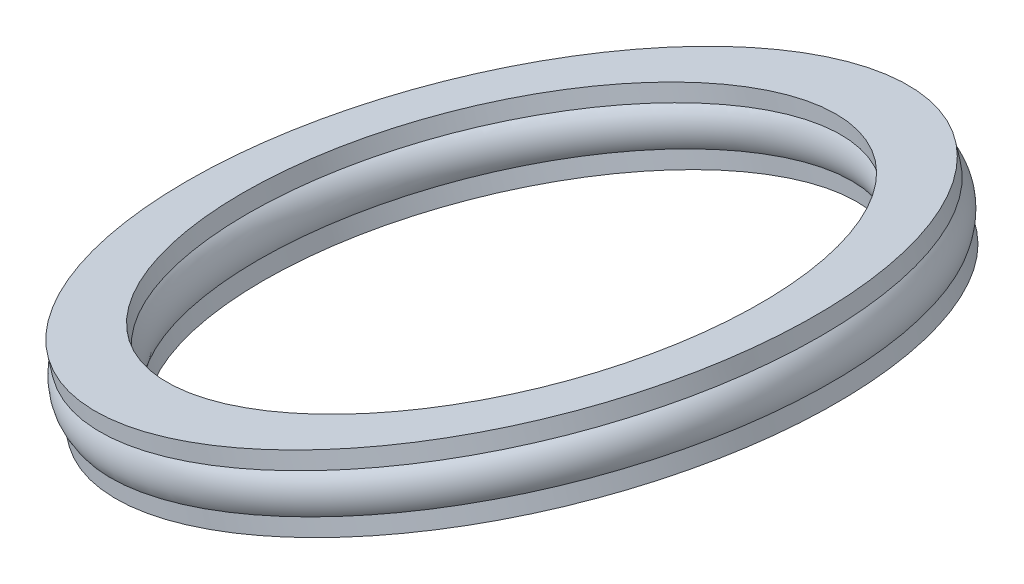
ISO-10303-21;
HEADER;
FILE_DESCRIPTION(('STEP AP214'),'2;1');
FILE_NAME('part.step','',(''),(''),'','','');
FILE_SCHEMA(('AUTOMOTIVE_DESIGN { 1 0 10303 214 1 1 1 1 }'));
ENDSEC;
DATA;
#1=APPLICATION_CONTEXT('core data for automotive mechanical design processes');
#2=APPLICATION_PROTOCOL_DEFINITION('international standard','automotive_design',2000,#1);
#3=PRODUCT_CONTEXT('',#1,'mechanical');
#4=PRODUCT('Part','Part','',(#3));
#5=PRODUCT_RELATED_PRODUCT_CATEGORY('part','',(#4));
#6=PRODUCT_DEFINITION_FORMATION('','',#4);
#7=PRODUCT_DEFINITION_CONTEXT('part definition',#1,'design');
#8=PRODUCT_DEFINITION('design','',#6,#7);
#9=PRODUCT_DEFINITION_SHAPE('','',#8);
#10=(LENGTH_UNIT() NAMED_UNIT(*) SI_UNIT(.MILLI.,.METRE.));
#11=(NAMED_UNIT(*) PLANE_ANGLE_UNIT() SI_UNIT($,.RADIAN.));
#12=(NAMED_UNIT(*) SI_UNIT($,.STERADIAN.) SOLID_ANGLE_UNIT());
#13=UNCERTAINTY_MEASURE_WITH_UNIT(LENGTH_MEASURE(1.E-05),#10,'distance_accuracy_value','');
#14=(GEOMETRIC_REPRESENTATION_CONTEXT(3) GLOBAL_UNCERTAINTY_ASSIGNED_CONTEXT((#13)) GLOBAL_UNIT_ASSIGNED_CONTEXT((#10,
#11,#12)) REPRESENTATION_CONTEXT('',''));
#15=CARTESIAN_POINT('',(0.,0.,0.));
#16=DIRECTION('',(0.,0.,1.));
#17=DIRECTION('',(1.,0.,0.));
#18=AXIS2_PLACEMENT_3D('',#15,#16,#17);
#19=CARTESIAN_POINT('',(408.798571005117,395.287429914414,0.));
#20=DIRECTION('',(-0.300714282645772,0.953714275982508,0.));
#21=DIRECTION('',(-0.953714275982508,-0.300714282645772,0.));
#22=AXIS2_PLACEMENT_3D('',#19,#20,#21);
#23=CYLINDRICAL_SURFACE('',#22,15.8000000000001);
#24=CARTESIAN_POINT('',(410.302142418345,390.518858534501,0.));
#25=DIRECTION('',(-0.300714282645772,0.953714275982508,0.));
#26=DIRECTION('',(-0.953714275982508,-0.300714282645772,0.));
#27=AXIS2_PLACEMENT_3D('',#24,#25,#26);
#28=CIRCLE('',#27,15.8);
#29=CARTESIAN_POINT('',(395.233456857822,385.767572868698,0.));
#30=VERTEX_POINT('',#29);
#31=EDGE_CURVE('E35',#30,#30,#28,.T.);
#32=ORIENTED_EDGE('',*,*,#31,.T.);
#33=EDGE_LOOP('',(#32));
#34=FACE_BOUND('',#33,.T.);
#35=CARTESIAN_POINT('',(410.586748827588,389.616230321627,0.));
#36=DIRECTION('',(0.300714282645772,-0.953714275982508,0.));
#37=DIRECTION('',(0.953714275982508,0.300714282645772,0.));
#38=AXIS2_PLACEMENT_3D('',#35,#36,#37);
#39=CIRCLE('',#38,15.8000000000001);
#40=CARTESIAN_POINT('',(425.655434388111,394.36751598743,0.));
#41=VERTEX_POINT('',#40);
#42=EDGE_CURVE('E10',#41,#41,#39,.F.);
#43=ORIENTED_EDGE('',*,*,#42,.F.);
#44=EDGE_LOOP('',(#43));
#45=FACE_BOUND('',#44,.T.);
#46=ADVANCED_FACE('F32',(#34,#45),#23,.F.);
#47=CARTESIAN_POINT('',(408.798571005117,395.287429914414,0.));
#48=DIRECTION('',(-0.300714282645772,0.953714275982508,0.));
#49=DIRECTION('',(-0.953714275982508,-0.300714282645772,0.));
#50=AXIS2_PLACEMENT_3D('',#47,#48,#49);
#51=CYLINDRICAL_SURFACE('',#50,19.2);
#52=CARTESIAN_POINT('',(410.302142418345,390.518858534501,0.));
#53=DIRECTION('',(-0.300714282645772,0.953714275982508,0.));
#54=DIRECTION('',(-0.953714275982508,-0.300714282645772,0.));
#55=AXIS2_PLACEMENT_3D('',#52,#53,#54);
#56=CIRCLE('',#55,19.2);
#57=CARTESIAN_POINT('',(391.990828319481,384.745144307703,0.));
#58=VERTEX_POINT('',#57);
#59=EDGE_CURVE('E53',#58,#58,#56,.T.);
#60=ORIENTED_EDGE('',*,*,#59,.F.);
#61=EDGE_LOOP('',(#60));
#62=FACE_BOUND('',#61,.T.);
#63=CARTESIAN_POINT('',(410.586748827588,389.616230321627,0.));
#64=DIRECTION('',(0.300714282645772,-0.953714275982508,0.));
#65=DIRECTION('',(0.953714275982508,0.300714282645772,0.));
#66=AXIS2_PLACEMENT_3D('',#63,#64,#65);
#67=CIRCLE('',#66,19.2);
#68=CARTESIAN_POINT('',(428.898062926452,395.389944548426,0.));
#69=VERTEX_POINT('',#68);
#70=EDGE_CURVE('E44',#69,#69,#67,.T.);
#71=ORIENTED_EDGE('',*,*,#70,.F.);
#72=EDGE_LOOP('',(#71));
#73=FACE_BOUND('',#72,.T.);
#74=ADVANCED_FACE('F70',(#62,#73),#51,.T.);
#75=CARTESIAN_POINT('',(425.370827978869,395.270144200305,0.));
#76=DIRECTION('',(0.300714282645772,-0.953714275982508,0.));
#77=DIRECTION('',(0.953714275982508,0.300714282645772,0.));
#78=AXIS2_PLACEMENT_3D('',#75,#76,#77);
#79=PLANE('',#78);
#80=ORIENTED_EDGE('',*,*,#59,.T.);
#81=EDGE_LOOP('',(#80));
#82=FACE_BOUND('',#81,.T.);
#83=ORIENTED_EDGE('',*,*,#31,.F.);
#84=EDGE_LOOP('',(#83));
#85=FACE_BOUND('',#84,.T.);
#86=ADVANCED_FACE('F72',(#82,#85),#79,.F.);
#87=CARTESIAN_POINT('',(410.903570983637,388.611429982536,0.));
#88=DIRECTION('',(-0.300714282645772,0.953714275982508,0.));
#89=DIRECTION('',(-0.953714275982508,-0.300714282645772,0.));
#90=AXIS2_PLACEMENT_3D('',#87,#88,#89);
#91=TOROIDAL_SURFACE('',#90,17.5,2.);
#92=CARTESIAN_POINT('',(411.220393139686,387.606629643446,0.));
#93=DIRECTION('',(-0.300714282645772,0.953714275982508,0.));
#94=DIRECTION('',(-0.953714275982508,-0.300714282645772,0.));
#95=AXIS2_PLACEMENT_3D('',#92,#93,#94);
#96=CIRCLE('',#95,19.2);
#97=CARTESIAN_POINT('',(392.909079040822,381.832915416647,0.));
#98=VERTEX_POINT('',#97);
#99=EDGE_CURVE('E58',#98,#98,#96,.T.);
#100=ORIENTED_EDGE('',*,*,#99,.T.);
#101=EDGE_LOOP('',(#100));
#102=FACE_BOUND('',#101,.T.);
#103=ORIENTED_EDGE('',*,*,#70,.T.);
#104=EDGE_LOOP('',(#103));
#105=FACE_BOUND('',#104,.T.);
#106=ADVANCED_FACE('F68',(#102,#105),#91,.T.);
#107=CARTESIAN_POINT('',(429.816313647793,392.47771565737,0.));
#108=DIRECTION('',(-0.300714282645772,0.953714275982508,0.));
#109=DIRECTION('',(-0.953714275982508,-0.300714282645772,0.));
#110=AXIS2_PLACEMENT_3D('',#107,#108,#109);
#111=PLANE('',#110);
#112=CARTESIAN_POINT('',(411.504999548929,386.704001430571,0.));
#113=DIRECTION('',(-0.300714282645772,0.953714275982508,0.));
#114=DIRECTION('',(-0.953714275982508,-0.300714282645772,0.));
#115=AXIS2_PLACEMENT_3D('',#112,#113,#114);
#116=CIRCLE('',#115,19.2000000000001);
#117=CARTESIAN_POINT('',(393.193685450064,380.930287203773,0.));
#118=VERTEX_POINT('',#117);
#119=EDGE_CURVE('E51',#118,#118,#116,.T.);
#120=ORIENTED_EDGE('',*,*,#119,.F.);
#121=EDGE_LOOP('',(#120));
#122=FACE_BOUND('',#121,.T.);
#123=CARTESIAN_POINT('',(411.504999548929,386.704001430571,0.));
#124=DIRECTION('',(-0.300714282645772,0.953714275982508,0.));
#125=DIRECTION('',(-0.953714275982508,-0.300714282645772,0.));
#126=AXIS2_PLACEMENT_3D('',#123,#124,#125);
#127=CIRCLE('',#126,15.8000000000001);
#128=CARTESIAN_POINT('',(396.436313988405,381.952715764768,0.));
#129=VERTEX_POINT('',#128);
#130=EDGE_CURVE('E48',#129,#129,#127,.T.);
#131=ORIENTED_EDGE('',*,*,#130,.T.);
#132=EDGE_LOOP('',(#131));
#133=FACE_BOUND('',#132,.T.);
#134=ADVANCED_FACE('F83',(#122,#133),#111,.F.);
#135=ORIENTED_EDGE('',*,*,#119,.T.);
#136=EDGE_LOOP('',(#135));
#137=FACE_BOUND('',#136,.T.);
#138=ORIENTED_EDGE('',*,*,#99,.F.);
#139=EDGE_LOOP('',(#138));
#140=FACE_BOUND('',#139,.T.);
#141=ADVANCED_FACE('F75',(#137,#140),#51,.T.);
#142=ORIENTED_EDGE('',*,*,#130,.F.);
#143=EDGE_LOOP('',(#142));
#144=FACE_BOUND('',#143,.T.);
#145=CARTESIAN_POINT('',(411.220393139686,387.606629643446,0.));
#146=DIRECTION('',(-0.300714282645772,0.953714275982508,0.));
#147=DIRECTION('',(-0.953714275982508,-0.300714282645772,0.));
#148=AXIS2_PLACEMENT_3D('',#145,#146,#147);
#149=CIRCLE('',#148,15.8000000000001);
#150=CARTESIAN_POINT('',(396.151707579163,382.855343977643,0.));
#151=VERTEX_POINT('',#150);
#152=EDGE_CURVE('E39',#151,#151,#149,.F.);
#153=ORIENTED_EDGE('',*,*,#152,.F.);
#154=EDGE_LOOP('',(#153));
#155=FACE_BOUND('',#154,.T.);
#156=ADVANCED_FACE('F80',(#144,#155),#23,.F.);
#157=ORIENTED_EDGE('',*,*,#152,.T.);
#158=EDGE_LOOP('',(#157));
#159=FACE_BOUND('',#158,.T.);
#160=ORIENTED_EDGE('',*,*,#42,.T.);
#161=EDGE_LOOP('',(#160));
#162=FACE_BOUND('',#161,.T.);
#163=ADVANCED_FACE('F89',(#159,#162),#91,.T.);
#164=CLOSED_SHELL('',(#46,#74,#86,#106,#134,#141,#156,#163));
#165=MANIFOLD_SOLID_BREP('B2',#164);
#166=ADVANCED_BREP_SHAPE_REPRESENTATION('',(#18,#165),#14);
#167=SHAPE_DEFINITION_REPRESENTATION(#9,#166);
ENDSEC;
END-ISO-10303-21;
